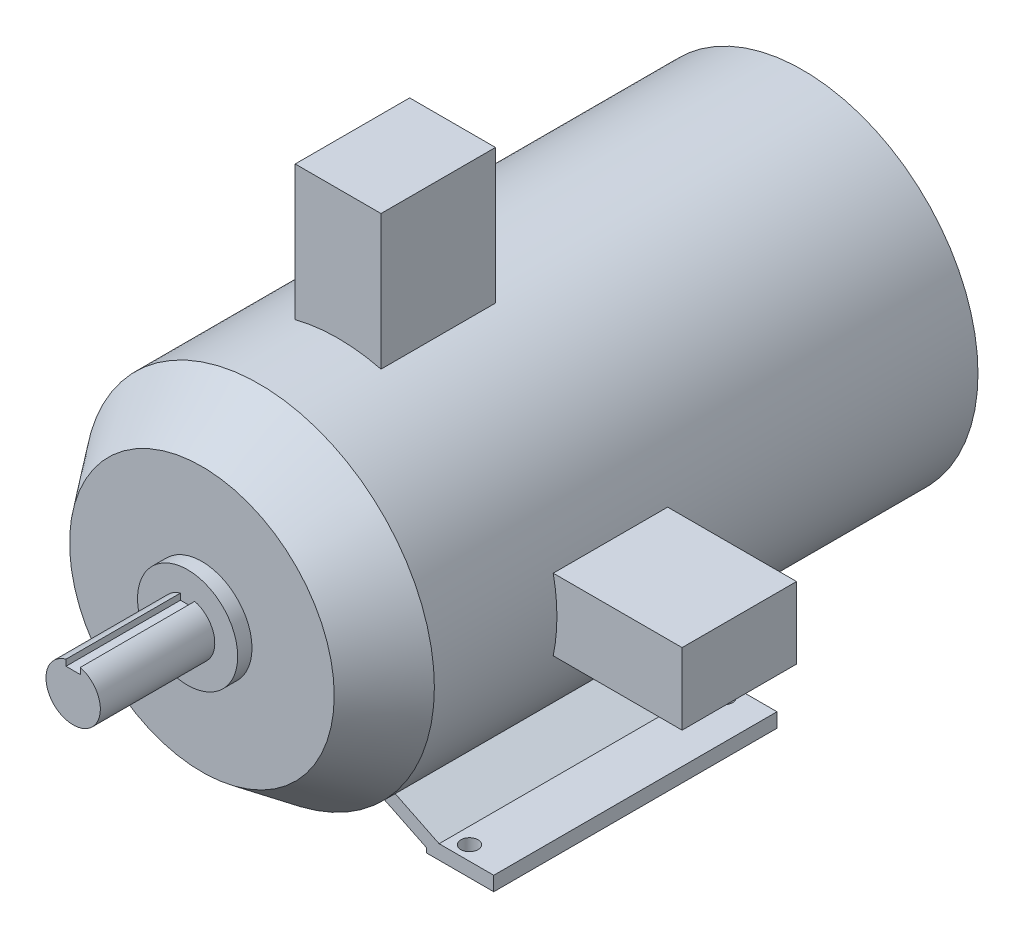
ISO-10303-21;
HEADER;
FILE_DESCRIPTION(('STEP AP214'),'2;1');
FILE_NAME('part.step','',(''),(''),'','','');
FILE_SCHEMA(('AUTOMOTIVE_DESIGN { 1 0 10303 214 1 1 1 1 }'));
ENDSEC;
DATA;
#1=APPLICATION_CONTEXT('core data for automotive mechanical design processes');
#2=APPLICATION_PROTOCOL_DEFINITION('international standard','automotive_design',2000,#1);
#3=PRODUCT_CONTEXT('',#1,'mechanical');
#4=PRODUCT('Part','Part','',(#3));
#5=PRODUCT_RELATED_PRODUCT_CATEGORY('part','',(#4));
#6=PRODUCT_DEFINITION_FORMATION('','',#4);
#7=PRODUCT_DEFINITION_CONTEXT('part definition',#1,'design');
#8=PRODUCT_DEFINITION('design','',#6,#7);
#9=PRODUCT_DEFINITION_SHAPE('','',#8);
#10=(LENGTH_UNIT() NAMED_UNIT(*) SI_UNIT(.MILLI.,.METRE.));
#11=(NAMED_UNIT(*) PLANE_ANGLE_UNIT() SI_UNIT($,.RADIAN.));
#12=(NAMED_UNIT(*) SI_UNIT($,.STERADIAN.) SOLID_ANGLE_UNIT());
#13=UNCERTAINTY_MEASURE_WITH_UNIT(LENGTH_MEASURE(1.E-05),#10,'distance_accuracy_value','');
#14=(GEOMETRIC_REPRESENTATION_CONTEXT(3) GLOBAL_UNCERTAINTY_ASSIGNED_CONTEXT((#13)) GLOBAL_UNIT_ASSIGNED_CONTEXT((#10,
#11,#12)) REPRESENTATION_CONTEXT('',''));
#15=CARTESIAN_POINT('',(0.,0.,0.));
#16=DIRECTION('',(0.,0.,1.));
#17=DIRECTION('',(1.,0.,0.));
#18=AXIS2_PLACEMENT_3D('',#15,#16,#17);
#19=CARTESIAN_POINT('',(0.,0.,420.));
#20=DIRECTION('',(0.,0.,-1.));
#21=DIRECTION('',(-1.,0.,0.));
#22=AXIS2_PLACEMENT_3D('',#19,#20,#21);
#23=CYLINDRICAL_SURFACE('',#22,122.5);
#24=CARTESIAN_POINT('',(0.,0.,294.347417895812));
#25=DIRECTION('',(0.,0.,-1.));
#26=DIRECTION('',(-1.,0.,0.));
#27=AXIS2_PLACEMENT_3D('',#24,#25,#26);
#28=CIRCLE('',#27,122.5);
#29=CARTESIAN_POINT('',(119.921849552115,25.,294.347417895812));
#30=VERTEX_POINT('',#29);
#31=CARTESIAN_POINT('',(119.921849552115,-25.,294.347417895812));
#32=VERTEX_POINT('',#31);
#33=EDGE_CURVE('E445',#30,#32,#28,.T.);
#34=ORIENTED_EDGE('',*,*,#33,.F.);
#35=DIRECTION('',(0.,0.,-1.));
#36=VECTOR('',#35,1.);
#37=CARTESIAN_POINT('',(119.921849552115,25.,420.));
#38=LINE('',#37,#36);
#39=CARTESIAN_POINT('',(119.921849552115,25.,214.347417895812));
#40=VERTEX_POINT('',#39);
#41=EDGE_CURVE('E436',#40,#30,#38,.F.);
#42=ORIENTED_EDGE('',*,*,#41,.F.);
#43=CARTESIAN_POINT('',(0.,0.,214.347417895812));
#44=DIRECTION('',(0.,0.,1.));
#45=DIRECTION('',(1.,0.,0.));
#46=AXIS2_PLACEMENT_3D('',#43,#44,#45);
#47=CIRCLE('',#46,122.5);
#48=CARTESIAN_POINT('',(119.921849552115,-25.,214.347417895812));
#49=VERTEX_POINT('',#48);
#50=EDGE_CURVE('E439',#49,#40,#47,.T.);
#51=ORIENTED_EDGE('',*,*,#50,.F.);
#52=DIRECTION('',(0.,0.,-1.));
#53=VECTOR('',#52,1.);
#54=CARTESIAN_POINT('',(119.921849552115,-25.,420.));
#55=LINE('',#54,#53);
#56=EDGE_CURVE('E442',#32,#49,#55,.T.);
#57=ORIENTED_EDGE('',*,*,#56,.F.);
#58=EDGE_LOOP('',(#34,#42,#51,#57));
#59=FACE_BOUND('',#58,.T.);
#60=CARTESIAN_POINT('',(0.,0.,153.));
#61=DIRECTION('',(0.,0.,-1.));
#62=DIRECTION('',(1.,0.,0.));
#63=AXIS2_PLACEMENT_3D('',#60,#61,#62);
#64=CIRCLE('',#63,122.5);
#65=CARTESIAN_POINT('',(-51.6029201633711,-111.100803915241,153.));
#66=VERTEX_POINT('',#65);
#67=CARTESIAN_POINT('',(-62.5646904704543,-105.318134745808,153.));
#68=VERTEX_POINT('',#67);
#69=EDGE_CURVE('E364',#66,#68,#64,.T.);
#70=ORIENTED_EDGE('',*,*,#69,.T.);
#71=DIRECTION('',(0.,0.,1.));
#72=VECTOR('',#71,1.);
#73=CARTESIAN_POINT('',(-62.5646904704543,-105.318134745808,153.));
#74=LINE('',#73,#72);
#75=CARTESIAN_POINT('',(-62.5646904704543,-105.318134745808,351.));
#76=VERTEX_POINT('',#75);
#77=EDGE_CURVE('E384',#68,#76,#74,.T.);
#78=ORIENTED_EDGE('',*,*,#77,.T.);
#79=CARTESIAN_POINT('',(0.,0.,351.));
#80=DIRECTION('',(0.,0.,-1.));
#81=DIRECTION('',(1.,0.,0.));
#82=AXIS2_PLACEMENT_3D('',#79,#80,#81);
#83=CIRCLE('',#82,122.5);
#84=CARTESIAN_POINT('',(-51.6029201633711,-111.100803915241,351.));
#85=VERTEX_POINT('',#84);
#86=EDGE_CURVE('E343',#85,#76,#83,.T.);
#87=ORIENTED_EDGE('',*,*,#86,.F.);
#88=DIRECTION('',(0.,0.,1.));
#89=VECTOR('',#88,1.);
#90=CARTESIAN_POINT('',(-51.6029201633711,-111.100803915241,153.));
#91=LINE('',#90,#89);
#92=EDGE_CURVE('E387',#66,#85,#91,.T.);
#93=ORIENTED_EDGE('',*,*,#92,.F.);
#94=EDGE_LOOP('',(#70,#78,#87,#93));
#95=FACE_BOUND('',#94,.T.);
#96=CARTESIAN_POINT('',(0.,0.,0.));
#97=DIRECTION('',(0.,0.,1.));
#98=DIRECTION('',(1.,0.,0.));
#99=AXIS2_PLACEMENT_3D('',#96,#97,#98);
#100=CIRCLE('',#99,122.5);
#101=CARTESIAN_POINT('',(122.5,0.,0.));
#102=VERTEX_POINT('',#101);
#103=EDGE_CURVE('E433',#102,#102,#100,.T.);
#104=ORIENTED_EDGE('',*,*,#103,.T.);
#105=EDGE_LOOP('',(#104));
#106=FACE_BOUND('',#105,.T.);
#107=CARTESIAN_POINT('',(0.,0.,380.));
#108=DIRECTION('',(0.,0.,1.));
#109=DIRECTION('',(1.,0.,0.));
#110=AXIS2_PLACEMENT_3D('',#107,#108,#109);
#111=CIRCLE('',#110,122.5);
#112=CARTESIAN_POINT('',(122.5,0.,380.));
#113=VERTEX_POINT('',#112);
#114=EDGE_CURVE('E418',#113,#113,#111,.T.);
#115=ORIENTED_EDGE('',*,*,#114,.F.);
#116=EDGE_LOOP('',(#115));
#117=FACE_BOUND('',#116,.T.);
#118=CARTESIAN_POINT('',(0.,0.,153.));
#119=DIRECTION('',(0.,0.,-1.));
#120=DIRECTION('',(1.,0.,0.));
#121=AXIS2_PLACEMENT_3D('',#118,#119,#120);
#122=CIRCLE('',#121,122.5);
#123=CARTESIAN_POINT('',(62.5646904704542,-105.318134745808,153.));
#124=VERTEX_POINT('',#123);
#125=CARTESIAN_POINT('',(51.6029201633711,-111.100803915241,153.));
#126=VERTEX_POINT('',#125);
#127=EDGE_CURVE('E310',#124,#126,#122,.T.);
#128=ORIENTED_EDGE('',*,*,#127,.T.);
#129=DIRECTION('',(0.,0.,1.));
#130=VECTOR('',#129,1.);
#131=CARTESIAN_POINT('',(51.6029201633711,-111.100803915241,153.));
#132=LINE('',#131,#130);
#133=CARTESIAN_POINT('',(51.6029201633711,-111.100803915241,351.));
#134=VERTEX_POINT('',#133);
#135=EDGE_CURVE('E325',#126,#134,#132,.T.);
#136=ORIENTED_EDGE('',*,*,#135,.T.);
#137=CARTESIAN_POINT('',(0.,0.,351.));
#138=DIRECTION('',(0.,0.,-1.));
#139=DIRECTION('',(1.,0.,0.));
#140=AXIS2_PLACEMENT_3D('',#137,#138,#139);
#141=CIRCLE('',#140,122.5);
#142=CARTESIAN_POINT('',(62.5646904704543,-105.318134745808,351.));
#143=VERTEX_POINT('',#142);
#144=EDGE_CURVE('E289',#143,#134,#141,.T.);
#145=ORIENTED_EDGE('',*,*,#144,.F.);
#146=DIRECTION('',(0.,0.,1.));
#147=VECTOR('',#146,1.);
#148=CARTESIAN_POINT('',(62.5646904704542,-105.318134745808,153.));
#149=LINE('',#148,#147);
#150=EDGE_CURVE('E328',#124,#143,#149,.T.);
#151=ORIENTED_EDGE('',*,*,#150,.F.);
#152=EDGE_LOOP('',(#128,#136,#145,#151));
#153=FACE_BOUND('',#152,.T.);
#154=DIRECTION('',(0.,0.,-1.));
#155=VECTOR('',#154,1.);
#156=CARTESIAN_POINT('',(-30.,118.769735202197,420.));
#157=LINE('',#156,#155);
#158=CARTESIAN_POINT('',(-30.,118.769735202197,244.794007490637));
#159=VERTEX_POINT('',#158);
#160=CARTESIAN_POINT('',(-30.,118.769735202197,324.794007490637));
#161=VERTEX_POINT('',#160);
#162=EDGE_CURVE('E11',#159,#161,#157,.F.);
#163=ORIENTED_EDGE('',*,*,#162,.F.);
#164=CARTESIAN_POINT('',(0.,0.,244.794007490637));
#165=DIRECTION('',(0.,0.,1.));
#166=DIRECTION('',(1.,0.,0.));
#167=AXIS2_PLACEMENT_3D('',#164,#165,#166);
#168=CIRCLE('',#167,122.5);
#169=CARTESIAN_POINT('',(30.,118.769735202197,244.794007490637));
#170=VERTEX_POINT('',#169);
#171=EDGE_CURVE('E448',#170,#159,#168,.T.);
#172=ORIENTED_EDGE('',*,*,#171,.F.);
#173=DIRECTION('',(0.,0.,-1.));
#174=VECTOR('',#173,1.);
#175=CARTESIAN_POINT('',(30.,118.769735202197,420.));
#176=LINE('',#175,#174);
#177=CARTESIAN_POINT('',(30.,118.769735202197,324.794007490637));
#178=VERTEX_POINT('',#177);
#179=EDGE_CURVE('E56',#178,#170,#176,.T.);
#180=ORIENTED_EDGE('',*,*,#179,.F.);
#181=CARTESIAN_POINT('',(0.,0.,324.794007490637));
#182=DIRECTION('',(0.,0.,-1.));
#183=DIRECTION('',(-1.,0.,0.));
#184=AXIS2_PLACEMENT_3D('',#181,#182,#183);
#185=CIRCLE('',#184,122.5);
#186=EDGE_CURVE('E46',#161,#178,#185,.T.);
#187=ORIENTED_EDGE('',*,*,#186,.F.);
#188=EDGE_LOOP('',(#163,#172,#180,#187));
#189=FACE_BOUND('',#188,.T.);
#190=ADVANCED_FACE('F39',(#59,#95,#106,#117,#153,#189),#23,.T.);
#191=CARTESIAN_POINT('',(0.,0.,420.));
#192=DIRECTION('',(0.,0.,1.));
#193=DIRECTION('',(1.,0.,0.));
#194=AXIS2_PLACEMENT_3D('',#191,#192,#193);
#195=PLANE('',#194);
#196=CARTESIAN_POINT('',(0.,0.,420.));
#197=DIRECTION('',(0.,0.,1.));
#198=DIRECTION('',(1.,0.,0.));
#199=AXIS2_PLACEMENT_3D('',#196,#197,#198);
#200=CIRCLE('',#199,35.);
#201=CARTESIAN_POINT('',(35.,0.,420.));
#202=VERTEX_POINT('',#201);
#203=EDGE_CURVE('E427',#202,#202,#200,.T.);
#204=ORIENTED_EDGE('',*,*,#203,.F.);
#205=EDGE_LOOP('',(#204));
#206=FACE_BOUND('',#205,.T.);
#207=CARTESIAN_POINT('',(0.,0.,420.));
#208=DIRECTION('',(0.,0.,1.));
#209=DIRECTION('',(1.,0.,0.));
#210=AXIS2_PLACEMENT_3D('',#207,#208,#209);
#211=CIRCLE('',#210,92.5);
#212=CARTESIAN_POINT('',(92.5,0.,420.));
#213=VERTEX_POINT('',#212);
#214=EDGE_CURVE('E415',#213,#213,#211,.T.);
#215=ORIENTED_EDGE('',*,*,#214,.T.);
#216=EDGE_LOOP('',(#215));
#217=FACE_BOUND('',#216,.T.);
#218=ADVANCED_FACE('F462',(#206,#217),#195,.T.);
#219=CARTESIAN_POINT('',(0.,0.,430.));
#220=DIRECTION('',(0.,0.,1.));
#221=DIRECTION('',(1.,0.,0.));
#222=AXIS2_PLACEMENT_3D('',#219,#220,#221);
#223=PLANE('',#222);
#224=CARTESIAN_POINT('',(0.,0.,430.));
#225=DIRECTION('',(0.,0.,1.));
#226=DIRECTION('',(1.,0.,0.));
#227=AXIS2_PLACEMENT_3D('',#224,#225,#226);
#228=CIRCLE('',#227,35.);
#229=CARTESIAN_POINT('',(35.,0.,430.));
#230=VERTEX_POINT('',#229);
#231=EDGE_CURVE('E430',#230,#230,#228,.T.);
#232=ORIENTED_EDGE('',*,*,#231,.T.);
#233=EDGE_LOOP('',(#232));
#234=FACE_BOUND('',#233,.T.);
#235=CARTESIAN_POINT('',(0.,0.,430.));
#236=DIRECTION('',(0.,0.,1.));
#237=DIRECTION('',(1.,0.,0.));
#238=AXIS2_PLACEMENT_3D('',#235,#236,#237);
#239=CIRCLE('',#238,19.);
#240=CARTESIAN_POINT('',(-4.99999999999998,18.3303027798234,430.));
#241=VERTEX_POINT('',#240);
#242=CARTESIAN_POINT('',(5.00000000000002,18.3303027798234,430.));
#243=VERTEX_POINT('',#242);
#244=EDGE_CURVE('E421',#241,#243,#239,.T.);
#245=ORIENTED_EDGE('',*,*,#244,.F.);
#246=DIRECTION('',(0.,1.,0.));
#247=VECTOR('',#246,1.);
#248=CARTESIAN_POINT('',(-4.99999999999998,18.3303027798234,430.));
#249=LINE('',#248,#247);
#250=CARTESIAN_POINT('',(-4.99999999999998,14.,430.));
#251=VERTEX_POINT('',#250);
#252=EDGE_CURVE('E398',#251,#241,#249,.T.);
#253=ORIENTED_EDGE('',*,*,#252,.F.);
#254=DIRECTION('',(-1.,0.,0.));
#255=VECTOR('',#254,1.);
#256=CARTESIAN_POINT('',(-4.99999999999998,14.,430.));
#257=LINE('',#256,#255);
#258=CARTESIAN_POINT('',(5.00000000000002,14.,430.));
#259=VERTEX_POINT('',#258);
#260=EDGE_CURVE('E393',#259,#251,#257,.T.);
#261=ORIENTED_EDGE('',*,*,#260,.F.);
#262=DIRECTION('',(0.,-1.,0.));
#263=VECTOR('',#262,1.);
#264=CARTESIAN_POINT('',(5.00000000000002,14.,430.));
#265=LINE('',#264,#263);
#266=EDGE_CURVE('E395',#243,#259,#265,.T.);
#267=ORIENTED_EDGE('',*,*,#266,.F.);
#268=EDGE_LOOP('',(#245,#253,#261,#267));
#269=FACE_BOUND('',#268,.T.);
#270=ADVANCED_FACE('F469',(#234,#269),#223,.T.);
#271=CARTESIAN_POINT('',(0.,0.,430.));
#272=DIRECTION('',(0.,0.,-1.));
#273=DIRECTION('',(-1.,0.,0.));
#274=AXIS2_PLACEMENT_3D('',#271,#272,#273);
#275=CYLINDRICAL_SURFACE('',#274,35.);
#276=ORIENTED_EDGE('',*,*,#231,.F.);
#277=EDGE_LOOP('',(#276));
#278=FACE_BOUND('',#277,.T.);
#279=ORIENTED_EDGE('',*,*,#203,.T.);
#280=EDGE_LOOP('',(#279));
#281=FACE_BOUND('',#280,.T.);
#282=ADVANCED_FACE('F590',(#278,#281),#275,.T.);
#283=CARTESIAN_POINT('',(0.,0.,510.));
#284=DIRECTION('',(0.,0.,-1.));
#285=DIRECTION('',(-1.,0.,0.));
#286=AXIS2_PLACEMENT_3D('',#283,#284,#285);
#287=CYLINDRICAL_SURFACE('',#286,19.);
#288=ORIENTED_EDGE('',*,*,#244,.T.);
#289=DIRECTION('',(0.,0.,1.));
#290=VECTOR('',#289,1.);
#291=CARTESIAN_POINT('',(5.00000000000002,18.3303027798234,418.819660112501));
#292=LINE('',#291,#290);
#293=CARTESIAN_POINT('',(5.00000000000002,18.3303027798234,510.));
#294=VERTEX_POINT('',#293);
#295=EDGE_CURVE('E396',#243,#294,#292,.T.);
#296=ORIENTED_EDGE('',*,*,#295,.T.);
#297=CARTESIAN_POINT('',(0.,0.,510.));
#298=DIRECTION('',(0.,0.,1.));
#299=DIRECTION('',(1.,0.,0.));
#300=AXIS2_PLACEMENT_3D('',#297,#298,#299);
#301=CIRCLE('',#300,19.);
#302=CARTESIAN_POINT('',(-4.99999999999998,18.3303027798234,510.));
#303=VERTEX_POINT('',#302);
#304=EDGE_CURVE('E424',#303,#294,#301,.T.);
#305=ORIENTED_EDGE('',*,*,#304,.F.);
#306=DIRECTION('',(0.,0.,1.));
#307=VECTOR('',#306,1.);
#308=CARTESIAN_POINT('',(-4.99999999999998,18.3303027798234,418.819660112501));
#309=LINE('',#308,#307);
#310=EDGE_CURVE('E406',#241,#303,#309,.T.);
#311=ORIENTED_EDGE('',*,*,#310,.F.);
#312=EDGE_LOOP('',(#288,#296,#305,#311));
#313=FACE_BOUND('',#312,.T.);
#314=ADVANCED_FACE('F586',(#313),#287,.T.);
#315=CARTESIAN_POINT('',(0.,0.,510.));
#316=DIRECTION('',(0.,0.,1.));
#317=DIRECTION('',(1.,0.,0.));
#318=AXIS2_PLACEMENT_3D('',#315,#316,#317);
#319=PLANE('',#318);
#320=DIRECTION('',(0.,1.,0.));
#321=VECTOR('',#320,1.);
#322=CARTESIAN_POINT('',(5.00000000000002,14.,510.));
#323=LINE('',#322,#321);
#324=CARTESIAN_POINT('',(5.00000000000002,14.,510.));
#325=VERTEX_POINT('',#324);
#326=EDGE_CURVE('E404',#325,#294,#323,.T.);
#327=ORIENTED_EDGE('',*,*,#326,.F.);
#328=DIRECTION('',(1.,0.,0.));
#329=VECTOR('',#328,1.);
#330=CARTESIAN_POINT('',(-4.99999999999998,14.,510.));
#331=LINE('',#330,#329);
#332=CARTESIAN_POINT('',(-4.99999999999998,14.,510.));
#333=VERTEX_POINT('',#332);
#334=EDGE_CURVE('E401',#333,#325,#331,.T.);
#335=ORIENTED_EDGE('',*,*,#334,.F.);
#336=DIRECTION('',(0.,-1.,0.));
#337=VECTOR('',#336,1.);
#338=CARTESIAN_POINT('',(-4.99999999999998,18.3303027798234,510.));
#339=LINE('',#338,#337);
#340=EDGE_CURVE('E379',#303,#333,#339,.T.);
#341=ORIENTED_EDGE('',*,*,#340,.F.);
#342=ORIENTED_EDGE('',*,*,#304,.T.);
#343=EDGE_LOOP('',(#327,#335,#341,#342));
#344=FACE_BOUND('',#343,.T.);
#345=ADVANCED_FACE('F582',(#344),#319,.T.);
#346=CARTESIAN_POINT('',(0.,0.,420.));
#347=DIRECTION('',(0.,0.,-1.));
#348=DIRECTION('',(-1.,0.,0.));
#349=AXIS2_PLACEMENT_3D('',#346,#347,#348);
#350=CONICAL_SURFACE('',#349,92.5,0.643501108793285);
#351=ORIENTED_EDGE('',*,*,#114,.T.);
#352=EDGE_LOOP('',(#351));
#353=FACE_BOUND('',#352,.T.);
#354=ORIENTED_EDGE('',*,*,#214,.F.);
#355=EDGE_LOOP('',(#354));
#356=FACE_BOUND('',#355,.T.);
#357=ADVANCED_FACE('F579',(#353,#356),#350,.T.);
#358=CARTESIAN_POINT('',(0.,0.,0.));
#359=DIRECTION('',(0.,0.,1.));
#360=DIRECTION('',(1.,0.,0.));
#361=AXIS2_PLACEMENT_3D('',#358,#359,#360);
#362=PLANE('',#361);
#363=ORIENTED_EDGE('',*,*,#103,.F.);
#364=EDGE_LOOP('',(#363));
#365=FACE_BOUND('',#364,.T.);
#366=ADVANCED_FACE('F571',(#365),#362,.F.);
#367=CARTESIAN_POINT('',(5.00000000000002,14.,418.819660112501));
#368=DIRECTION('',(1.,0.,0.));
#369=DIRECTION('',(0.,1.,0.));
#370=AXIS2_PLACEMENT_3D('',#367,#368,#369);
#371=PLANE('',#370);
#372=ORIENTED_EDGE('',*,*,#266,.T.);
#373=DIRECTION('',(0.,0.,1.));
#374=VECTOR('',#373,1.);
#375=CARTESIAN_POINT('',(5.00000000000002,14.,418.819660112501));
#376=LINE('',#375,#374);
#377=EDGE_CURVE('E409',#259,#325,#376,.T.);
#378=ORIENTED_EDGE('',*,*,#377,.T.);
#379=ORIENTED_EDGE('',*,*,#326,.T.);
#380=ORIENTED_EDGE('',*,*,#295,.F.);
#381=EDGE_LOOP('',(#372,#378,#379,#380));
#382=FACE_BOUND('',#381,.T.);
#383=ADVANCED_FACE('F567',(#382),#371,.F.);
#384=CARTESIAN_POINT('',(-4.99999999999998,14.,418.819660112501));
#385=DIRECTION('',(0.,-1.,0.));
#386=DIRECTION('',(0.,0.,-1.));
#387=AXIS2_PLACEMENT_3D('',#384,#385,#386);
#388=PLANE('',#387);
#389=ORIENTED_EDGE('',*,*,#260,.T.);
#390=DIRECTION('',(0.,0.,1.));
#391=VECTOR('',#390,1.);
#392=CARTESIAN_POINT('',(-4.99999999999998,14.,418.819660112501));
#393=LINE('',#392,#391);
#394=EDGE_CURVE('E411',#251,#333,#393,.T.);
#395=ORIENTED_EDGE('',*,*,#394,.T.);
#396=ORIENTED_EDGE('',*,*,#334,.T.);
#397=ORIENTED_EDGE('',*,*,#377,.F.);
#398=EDGE_LOOP('',(#389,#395,#396,#397));
#399=FACE_BOUND('',#398,.T.);
#400=ADVANCED_FACE('F570',(#399),#388,.F.);
#401=CARTESIAN_POINT('',(-4.99999999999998,18.3303027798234,418.819660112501));
#402=DIRECTION('',(-1.,0.,0.));
#403=DIRECTION('',(0.,0.,1.));
#404=AXIS2_PLACEMENT_3D('',#401,#402,#403);
#405=PLANE('',#404);
#406=ORIENTED_EDGE('',*,*,#252,.T.);
#407=ORIENTED_EDGE('',*,*,#310,.T.);
#408=ORIENTED_EDGE('',*,*,#340,.T.);
#409=ORIENTED_EDGE('',*,*,#394,.F.);
#410=EDGE_LOOP('',(#406,#407,#408,#409));
#411=FACE_BOUND('',#410,.T.);
#412=ADVANCED_FACE('F565',(#411),#405,.F.);
#413=CARTESIAN_POINT('',(-88.,-132.,153.));
#414=DIRECTION('',(0.,-1.,0.));
#415=DIRECTION('',(0.,0.,-1.));
#416=AXIS2_PLACEMENT_3D('',#413,#414,#415);
#417=PLANE('',#416);
#418=CARTESIAN_POINT('',(-108.,-132.,163.));
#419=DIRECTION('',(0.,-1.,0.));
#420=DIRECTION('',(0.,0.,-1.));
#421=AXIS2_PLACEMENT_3D('',#418,#419,#420);
#422=CIRCLE('',#421,6.);
#423=CARTESIAN_POINT('',(-108.,-132.,157.));
#424=VERTEX_POINT('',#423);
#425=EDGE_CURVE('E254',#424,#424,#422,.T.);
#426=ORIENTED_EDGE('',*,*,#425,.F.);
#427=EDGE_LOOP('',(#426));
#428=FACE_BOUND('',#427,.T.);
#429=CARTESIAN_POINT('',(-108.,-132.,341.));
#430=DIRECTION('',(0.,-1.,0.));
#431=DIRECTION('',(0.,0.,-1.));
#432=AXIS2_PLACEMENT_3D('',#429,#430,#431);
#433=CIRCLE('',#432,6.);
#434=CARTESIAN_POINT('',(-108.,-132.,335.));
#435=VERTEX_POINT('',#434);
#436=EDGE_CURVE('E260',#435,#435,#433,.T.);
#437=ORIENTED_EDGE('',*,*,#436,.F.);
#438=EDGE_LOOP('',(#437));
#439=FACE_BOUND('',#438,.T.);
#440=DIRECTION('',(1.,0.,0.));
#441=VECTOR('',#440,1.);
#442=CARTESIAN_POINT('',(-88.,-132.,351.));
#443=LINE('',#442,#441);
#444=CARTESIAN_POINT('',(-135.,-132.,351.));
#445=VERTEX_POINT('',#444);
#446=CARTESIAN_POINT('',(-88.,-132.,351.));
#447=VERTEX_POINT('',#446);
#448=EDGE_CURVE('E322',#445,#447,#443,.T.);
#449=ORIENTED_EDGE('',*,*,#448,.F.);
#450=DIRECTION('',(0.,0.,1.));
#451=VECTOR('',#450,1.);
#452=CARTESIAN_POINT('',(-135.,-132.,153.));
#453=LINE('',#452,#451);
#454=CARTESIAN_POINT('',(-135.,-132.,153.));
#455=VERTEX_POINT('',#454);
#456=EDGE_CURVE('E377',#455,#445,#453,.T.);
#457=ORIENTED_EDGE('',*,*,#456,.F.);
#458=DIRECTION('',(1.,0.,0.));
#459=VECTOR('',#458,1.);
#460=CARTESIAN_POINT('',(-88.,-132.,153.));
#461=LINE('',#460,#459);
#462=CARTESIAN_POINT('',(-88.,-132.,153.));
#463=VERTEX_POINT('',#462);
#464=EDGE_CURVE('E355',#455,#463,#461,.T.);
#465=ORIENTED_EDGE('',*,*,#464,.T.);
#466=DIRECTION('',(0.,0.,1.));
#467=VECTOR('',#466,1.);
#468=CARTESIAN_POINT('',(-88.,-132.,153.));
#469=LINE('',#468,#467);
#470=EDGE_CURVE('E376',#463,#447,#469,.T.);
#471=ORIENTED_EDGE('',*,*,#470,.T.);
#472=EDGE_LOOP('',(#449,#457,#465,#471));
#473=FACE_BOUND('',#472,.T.);
#474=ADVANCED_FACE('F548',(#428,#439,#473),#417,.T.);
#475=CARTESIAN_POINT('',(-135.,-132.,153.));
#476=DIRECTION('',(-1.,0.,0.));
#477=DIRECTION('',(0.,-1.,0.));
#478=AXIS2_PLACEMENT_3D('',#475,#476,#477);
#479=PLANE('',#478);
#480=DIRECTION('',(0.,-1.,0.));
#481=VECTOR('',#480,1.);
#482=CARTESIAN_POINT('',(-135.,-132.,351.));
#483=LINE('',#482,#481);
#484=CARTESIAN_POINT('',(-135.,-122.,351.));
#485=VERTEX_POINT('',#484);
#486=EDGE_CURVE('E352',#485,#445,#483,.T.);
#487=ORIENTED_EDGE('',*,*,#486,.F.);
#488=DIRECTION('',(0.,0.,1.));
#489=VECTOR('',#488,1.);
#490=CARTESIAN_POINT('',(-135.,-122.,153.));
#491=LINE('',#490,#489);
#492=CARTESIAN_POINT('',(-135.,-122.,153.));
#493=VERTEX_POINT('',#492);
#494=EDGE_CURVE('E380',#493,#485,#491,.T.);
#495=ORIENTED_EDGE('',*,*,#494,.F.);
#496=DIRECTION('',(0.,-1.,0.));
#497=VECTOR('',#496,1.);
#498=CARTESIAN_POINT('',(-135.,-132.,153.));
#499=LINE('',#498,#497);
#500=EDGE_CURVE('E373',#493,#455,#499,.T.);
#501=ORIENTED_EDGE('',*,*,#500,.T.);
#502=ORIENTED_EDGE('',*,*,#456,.T.);
#503=EDGE_LOOP('',(#487,#495,#501,#502));
#504=FACE_BOUND('',#503,.T.);
#505=ADVANCED_FACE('F544',(#504),#479,.T.);
#506=CARTESIAN_POINT('',(-135.,-122.,153.));
#507=DIRECTION('',(0.,1.,0.));
#508=DIRECTION('',(0.,0.,1.));
#509=AXIS2_PLACEMENT_3D('',#506,#507,#508);
#510=PLANE('',#509);
#511=CARTESIAN_POINT('',(-108.,-122.,163.));
#512=DIRECTION('',(0.,-1.,0.));
#513=DIRECTION('',(0.,0.,-1.));
#514=AXIS2_PLACEMENT_3D('',#511,#512,#513);
#515=CIRCLE('',#514,6.);
#516=CARTESIAN_POINT('',(-108.,-122.,157.));
#517=VERTEX_POINT('',#516);
#518=EDGE_CURVE('E257',#517,#517,#515,.T.);
#519=ORIENTED_EDGE('',*,*,#518,.T.);
#520=EDGE_LOOP('',(#519));
#521=FACE_BOUND('',#520,.T.);
#522=CARTESIAN_POINT('',(-108.,-122.,341.));
#523=DIRECTION('',(0.,-1.,0.));
#524=DIRECTION('',(0.,0.,-1.));
#525=AXIS2_PLACEMENT_3D('',#522,#523,#524);
#526=CIRCLE('',#525,6.);
#527=CARTESIAN_POINT('',(-108.,-122.,335.));
#528=VERTEX_POINT('',#527);
#529=EDGE_CURVE('E263',#528,#528,#526,.T.);
#530=ORIENTED_EDGE('',*,*,#529,.T.);
#531=EDGE_LOOP('',(#530));
#532=FACE_BOUND('',#531,.T.);
#533=DIRECTION('',(-1.,0.,0.));
#534=VECTOR('',#533,1.);
#535=CARTESIAN_POINT('',(-135.,-122.,351.));
#536=LINE('',#535,#534);
#537=CARTESIAN_POINT('',(-96.8002525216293,-122.,351.));
#538=VERTEX_POINT('',#537);
#539=EDGE_CURVE('E349',#538,#485,#536,.T.);
#540=ORIENTED_EDGE('',*,*,#539,.F.);
#541=DIRECTION('',(0.,0.,1.));
#542=VECTOR('',#541,1.);
#543=CARTESIAN_POINT('',(-96.8002525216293,-122.,153.));
#544=LINE('',#543,#542);
#545=CARTESIAN_POINT('',(-96.8002525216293,-122.,153.));
#546=VERTEX_POINT('',#545);
#547=EDGE_CURVE('E382',#546,#538,#544,.T.);
#548=ORIENTED_EDGE('',*,*,#547,.F.);
#549=DIRECTION('',(-1.,0.,0.));
#550=VECTOR('',#549,1.);
#551=CARTESIAN_POINT('',(-135.,-122.,153.));
#552=LINE('',#551,#550);
#553=EDGE_CURVE('E370',#546,#493,#552,.T.);
#554=ORIENTED_EDGE('',*,*,#553,.T.);
#555=ORIENTED_EDGE('',*,*,#494,.T.);
#556=EDGE_LOOP('',(#540,#548,#554,#555));
#557=FACE_BOUND('',#556,.T.);
#558=ADVANCED_FACE('F547',(#521,#532,#557),#510,.T.);
#559=CARTESIAN_POINT('',(-62.5646904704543,-105.318134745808,153.));
#560=DIRECTION('',(-0.43803312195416,0.898958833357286,0.));
#561=DIRECTION('',(-0.898958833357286,-0.43803312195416,0.));
#562=AXIS2_PLACEMENT_3D('',#559,#560,#561);
#563=PLANE('',#562);
#564=DIRECTION('',(-0.898958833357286,-0.43803312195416,0.));
#565=VECTOR('',#564,1.);
#566=CARTESIAN_POINT('',(-62.5646904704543,-105.318134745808,351.));
#567=LINE('',#566,#565);
#568=EDGE_CURVE('E346',#76,#538,#567,.T.);
#569=ORIENTED_EDGE('',*,*,#568,.F.);
#570=ORIENTED_EDGE('',*,*,#77,.F.);
#571=DIRECTION('',(-0.898958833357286,-0.43803312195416,0.));
#572=VECTOR('',#571,1.);
#573=CARTESIAN_POINT('',(-62.5646904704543,-105.318134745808,153.));
#574=LINE('',#573,#572);
#575=EDGE_CURVE('E367',#68,#546,#574,.T.);
#576=ORIENTED_EDGE('',*,*,#575,.T.);
#577=ORIENTED_EDGE('',*,*,#547,.T.);
#578=EDGE_LOOP('',(#569,#570,#576,#577));
#579=FACE_BOUND('',#578,.T.);
#580=ADVANCED_FACE('F552',(#579),#563,.T.);
#581=CARTESIAN_POINT('',(-88.,-128.8359058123,153.));
#582=DIRECTION('',(0.438033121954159,-0.898958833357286,0.));
#583=DIRECTION('',(0.898958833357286,0.438033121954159,0.));
#584=AXIS2_PLACEMENT_3D('',#581,#582,#583);
#585=PLANE('',#584);
#586=DIRECTION('',(0.898958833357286,0.438033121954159,0.));
#587=VECTOR('',#586,1.);
#588=CARTESIAN_POINT('',(-88.,-128.8359058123,351.));
#589=LINE('',#588,#587);
#590=CARTESIAN_POINT('',(-88.,-128.8359058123,351.));
#591=VERTEX_POINT('',#590);
#592=EDGE_CURVE('E341',#591,#85,#589,.T.);
#593=ORIENTED_EDGE('',*,*,#592,.F.);
#594=DIRECTION('',(0.,0.,1.));
#595=VECTOR('',#594,1.);
#596=CARTESIAN_POINT('',(-88.,-128.8359058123,153.));
#597=LINE('',#596,#595);
#598=CARTESIAN_POINT('',(-88.,-128.8359058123,153.));
#599=VERTEX_POINT('',#598);
#600=EDGE_CURVE('E390',#599,#591,#597,.T.);
#601=ORIENTED_EDGE('',*,*,#600,.F.);
#602=DIRECTION('',(0.898958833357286,0.438033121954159,0.));
#603=VECTOR('',#602,1.);
#604=CARTESIAN_POINT('',(-88.,-128.8359058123,153.));
#605=LINE('',#604,#603);
#606=EDGE_CURVE('E361',#599,#66,#605,.T.);
#607=ORIENTED_EDGE('',*,*,#606,.T.);
#608=ORIENTED_EDGE('',*,*,#92,.T.);
#609=EDGE_LOOP('',(#593,#601,#607,#608));
#610=FACE_BOUND('',#609,.T.);
#611=ADVANCED_FACE('F556',(#610),#585,.T.);
#612=CARTESIAN_POINT('',(-88.,-128.8359058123,153.));
#613=DIRECTION('',(1.,0.,0.));
#614=DIRECTION('',(0.,0.,-1.));
#615=AXIS2_PLACEMENT_3D('',#612,#613,#614);
#616=PLANE('',#615);
#617=DIRECTION('',(0.,1.,0.));
#618=VECTOR('',#617,1.);
#619=CARTESIAN_POINT('',(-88.,-128.8359058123,351.));
#620=LINE('',#619,#618);
#621=EDGE_CURVE('E338',#447,#591,#620,.T.);
#622=ORIENTED_EDGE('',*,*,#621,.F.);
#623=ORIENTED_EDGE('',*,*,#470,.F.);
#624=DIRECTION('',(0.,1.,0.));
#625=VECTOR('',#624,1.);
#626=CARTESIAN_POINT('',(-88.,-128.8359058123,153.));
#627=LINE('',#626,#625);
#628=EDGE_CURVE('E358',#463,#599,#627,.T.);
#629=ORIENTED_EDGE('',*,*,#628,.T.);
#630=ORIENTED_EDGE('',*,*,#600,.T.);
#631=EDGE_LOOP('',(#622,#623,#629,#630));
#632=FACE_BOUND('',#631,.T.);
#633=ADVANCED_FACE('F542',(#632),#616,.T.);
#634=CARTESIAN_POINT('',(0.,0.,153.));
#635=DIRECTION('',(0.,0.,1.));
#636=DIRECTION('',(1.,0.,0.));
#637=AXIS2_PLACEMENT_3D('',#634,#635,#636);
#638=PLANE('',#637);
#639=ORIENTED_EDGE('',*,*,#464,.F.);
#640=ORIENTED_EDGE('',*,*,#500,.F.);
#641=ORIENTED_EDGE('',*,*,#553,.F.);
#642=ORIENTED_EDGE('',*,*,#575,.F.);
#643=ORIENTED_EDGE('',*,*,#69,.F.);
#644=ORIENTED_EDGE('',*,*,#606,.F.);
#645=ORIENTED_EDGE('',*,*,#628,.F.);
#646=EDGE_LOOP('',(#639,#640,#641,#642,#643,#644,#645));
#647=FACE_BOUND('',#646,.T.);
#648=ADVANCED_FACE('F538',(#647),#638,.F.);
#649=CARTESIAN_POINT('',(0.,0.,351.));
#650=DIRECTION('',(0.,0.,1.));
#651=DIRECTION('',(1.,0.,0.));
#652=AXIS2_PLACEMENT_3D('',#649,#650,#651);
#653=PLANE('',#652);
#654=ORIENTED_EDGE('',*,*,#448,.T.);
#655=ORIENTED_EDGE('',*,*,#621,.T.);
#656=ORIENTED_EDGE('',*,*,#592,.T.);
#657=ORIENTED_EDGE('',*,*,#86,.T.);
#658=ORIENTED_EDGE('',*,*,#568,.T.);
#659=ORIENTED_EDGE('',*,*,#539,.T.);
#660=ORIENTED_EDGE('',*,*,#486,.T.);
#661=EDGE_LOOP('',(#654,#655,#656,#657,#658,#659,#660));
#662=FACE_BOUND('',#661,.T.);
#663=ADVANCED_FACE('F534',(#662),#653,.T.);
#664=CARTESIAN_POINT('',(135.,-132.,153.));
#665=DIRECTION('',(0.,-1.,0.));
#666=DIRECTION('',(1.,0.,0.));
#667=AXIS2_PLACEMENT_3D('',#664,#665,#666);
#668=PLANE('',#667);
#669=CARTESIAN_POINT('',(108.,-132.,163.));
#670=DIRECTION('',(0.,-1.,0.));
#671=DIRECTION('',(0.,0.,-1.));
#672=AXIS2_PLACEMENT_3D('',#669,#670,#671);
#673=CIRCLE('',#672,6.);
#674=CARTESIAN_POINT('',(108.,-132.,157.));
#675=VERTEX_POINT('',#674);
#676=EDGE_CURVE('E266',#675,#675,#673,.T.);
#677=ORIENTED_EDGE('',*,*,#676,.F.);
#678=EDGE_LOOP('',(#677));
#679=FACE_BOUND('',#678,.T.);
#680=CARTESIAN_POINT('',(108.,-132.,341.));
#681=DIRECTION('',(0.,-1.,0.));
#682=DIRECTION('',(0.,0.,-1.));
#683=AXIS2_PLACEMENT_3D('',#680,#681,#682);
#684=CIRCLE('',#683,6.);
#685=CARTESIAN_POINT('',(108.,-132.,335.));
#686=VERTEX_POINT('',#685);
#687=EDGE_CURVE('E272',#686,#686,#684,.T.);
#688=ORIENTED_EDGE('',*,*,#687,.F.);
#689=EDGE_LOOP('',(#688));
#690=FACE_BOUND('',#689,.T.);
#691=DIRECTION('',(1.,0.,0.));
#692=VECTOR('',#691,1.);
#693=CARTESIAN_POINT('',(135.,-132.,351.));
#694=LINE('',#693,#692);
#695=CARTESIAN_POINT('',(88.,-132.,351.));
#696=VERTEX_POINT('',#695);
#697=CARTESIAN_POINT('',(135.,-132.,351.));
#698=VERTEX_POINT('',#697);
#699=EDGE_CURVE('E278',#696,#698,#694,.T.);
#700=ORIENTED_EDGE('',*,*,#699,.F.);
#701=DIRECTION('',(0.,0.,1.));
#702=VECTOR('',#701,1.);
#703=CARTESIAN_POINT('',(88.,-132.,153.));
#704=LINE('',#703,#702);
#705=CARTESIAN_POINT('',(88.,-132.,153.));
#706=VERTEX_POINT('',#705);
#707=EDGE_CURVE('E320',#706,#696,#704,.T.);
#708=ORIENTED_EDGE('',*,*,#707,.F.);
#709=DIRECTION('',(1.,0.,0.));
#710=VECTOR('',#709,1.);
#711=CARTESIAN_POINT('',(135.,-132.,153.));
#712=LINE('',#711,#710);
#713=CARTESIAN_POINT('',(135.,-132.,153.));
#714=VERTEX_POINT('',#713);
#715=EDGE_CURVE('E298',#706,#714,#712,.T.);
#716=ORIENTED_EDGE('',*,*,#715,.T.);
#717=DIRECTION('',(0.,0.,1.));
#718=VECTOR('',#717,1.);
#719=CARTESIAN_POINT('',(135.,-132.,153.));
#720=LINE('',#719,#718);
#721=EDGE_CURVE('E319',#714,#698,#720,.T.);
#722=ORIENTED_EDGE('',*,*,#721,.T.);
#723=EDGE_LOOP('',(#700,#708,#716,#722));
#724=FACE_BOUND('',#723,.T.);
#725=ADVANCED_FACE('F499',(#679,#690,#724),#668,.T.);
#726=CARTESIAN_POINT('',(88.,-132.,153.));
#727=DIRECTION('',(-1.,0.,0.));
#728=DIRECTION('',(0.,0.,1.));
#729=AXIS2_PLACEMENT_3D('',#726,#727,#728);
#730=PLANE('',#729);
#731=DIRECTION('',(0.,-1.,0.));
#732=VECTOR('',#731,1.);
#733=CARTESIAN_POINT('',(88.,-132.,351.));
#734=LINE('',#733,#732);
#735=CARTESIAN_POINT('',(88.,-128.8359058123,351.));
#736=VERTEX_POINT('',#735);
#737=EDGE_CURVE('E295',#736,#696,#734,.T.);
#738=ORIENTED_EDGE('',*,*,#737,.F.);
#739=DIRECTION('',(0.,0.,1.));
#740=VECTOR('',#739,1.);
#741=CARTESIAN_POINT('',(88.,-128.8359058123,153.));
#742=LINE('',#741,#740);
#743=CARTESIAN_POINT('',(88.,-128.8359058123,153.));
#744=VERTEX_POINT('',#743);
#745=EDGE_CURVE('E323',#744,#736,#742,.T.);
#746=ORIENTED_EDGE('',*,*,#745,.F.);
#747=DIRECTION('',(0.,-1.,0.));
#748=VECTOR('',#747,1.);
#749=CARTESIAN_POINT('',(88.,-132.,153.));
#750=LINE('',#749,#748);
#751=EDGE_CURVE('E316',#744,#706,#750,.T.);
#752=ORIENTED_EDGE('',*,*,#751,.T.);
#753=ORIENTED_EDGE('',*,*,#707,.T.);
#754=EDGE_LOOP('',(#738,#746,#752,#753));
#755=FACE_BOUND('',#754,.T.);
#756=ADVANCED_FACE('F502',(#755),#730,.T.);
#757=CARTESIAN_POINT('',(51.6029201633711,-111.100803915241,153.));
#758=DIRECTION('',(-0.438033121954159,-0.898958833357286,0.));
#759=DIRECTION('',(0.898958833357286,-0.438033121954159,0.));
#760=AXIS2_PLACEMENT_3D('',#757,#758,#759);
#761=PLANE('',#760);
#762=DIRECTION('',(0.898958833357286,-0.438033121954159,0.));
#763=VECTOR('',#762,1.);
#764=CARTESIAN_POINT('',(51.6029201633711,-111.100803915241,351.));
#765=LINE('',#764,#763);
#766=EDGE_CURVE('E292',#134,#736,#765,.T.);
#767=ORIENTED_EDGE('',*,*,#766,.F.);
#768=ORIENTED_EDGE('',*,*,#135,.F.);
#769=DIRECTION('',(0.898958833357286,-0.438033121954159,0.));
#770=VECTOR('',#769,1.);
#771=CARTESIAN_POINT('',(51.6029201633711,-111.100803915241,153.));
#772=LINE('',#771,#770);
#773=EDGE_CURVE('E313',#126,#744,#772,.T.);
#774=ORIENTED_EDGE('',*,*,#773,.T.);
#775=ORIENTED_EDGE('',*,*,#745,.T.);
#776=EDGE_LOOP('',(#767,#768,#774,#775));
#777=FACE_BOUND('',#776,.T.);
#778=ADVANCED_FACE('F504',(#777),#761,.T.);
#779=CARTESIAN_POINT('',(96.8002525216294,-122.,153.));
#780=DIRECTION('',(0.438033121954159,0.898958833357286,0.));
#781=DIRECTION('',(-0.898958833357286,0.438033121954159,0.));
#782=AXIS2_PLACEMENT_3D('',#779,#780,#781);
#783=PLANE('',#782);
#784=DIRECTION('',(-0.898958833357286,0.438033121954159,0.));
#785=VECTOR('',#784,1.);
#786=CARTESIAN_POINT('',(96.8002525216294,-122.,351.));
#787=LINE('',#786,#785);
#788=CARTESIAN_POINT('',(96.8002525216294,-122.,351.));
#789=VERTEX_POINT('',#788);
#790=EDGE_CURVE('E287',#789,#143,#787,.T.);
#791=ORIENTED_EDGE('',*,*,#790,.F.);
#792=DIRECTION('',(0.,0.,1.));
#793=VECTOR('',#792,1.);
#794=CARTESIAN_POINT('',(96.8002525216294,-122.,153.));
#795=LINE('',#794,#793);
#796=CARTESIAN_POINT('',(96.8002525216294,-122.,153.));
#797=VERTEX_POINT('',#796);
#798=EDGE_CURVE('E331',#797,#789,#795,.T.);
#799=ORIENTED_EDGE('',*,*,#798,.F.);
#800=DIRECTION('',(-0.898958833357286,0.438033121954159,0.));
#801=VECTOR('',#800,1.);
#802=CARTESIAN_POINT('',(96.8002525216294,-122.,153.));
#803=LINE('',#802,#801);
#804=EDGE_CURVE('E307',#797,#124,#803,.T.);
#805=ORIENTED_EDGE('',*,*,#804,.T.);
#806=ORIENTED_EDGE('',*,*,#150,.T.);
#807=EDGE_LOOP('',(#791,#799,#805,#806));
#808=FACE_BOUND('',#807,.T.);
#809=ADVANCED_FACE('F489',(#808),#783,.T.);
#810=CARTESIAN_POINT('',(96.8002525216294,-122.,153.));
#811=DIRECTION('',(0.,1.,0.));
#812=DIRECTION('',(0.,0.,1.));
#813=AXIS2_PLACEMENT_3D('',#810,#811,#812);
#814=PLANE('',#813);
#815=CARTESIAN_POINT('',(108.,-122.,163.));
#816=DIRECTION('',(0.,-1.,0.));
#817=DIRECTION('',(0.,0.,-1.));
#818=AXIS2_PLACEMENT_3D('',#815,#816,#817);
#819=CIRCLE('',#818,6.);
#820=CARTESIAN_POINT('',(108.,-122.,157.));
#821=VERTEX_POINT('',#820);
#822=EDGE_CURVE('E269',#821,#821,#819,.T.);
#823=ORIENTED_EDGE('',*,*,#822,.T.);
#824=EDGE_LOOP('',(#823));
#825=FACE_BOUND('',#824,.T.);
#826=CARTESIAN_POINT('',(108.,-122.,341.));
#827=DIRECTION('',(0.,-1.,0.));
#828=DIRECTION('',(0.,0.,-1.));
#829=AXIS2_PLACEMENT_3D('',#826,#827,#828);
#830=CIRCLE('',#829,6.);
#831=CARTESIAN_POINT('',(108.,-122.,335.));
#832=VERTEX_POINT('',#831);
#833=EDGE_CURVE('E275',#832,#832,#830,.T.);
#834=ORIENTED_EDGE('',*,*,#833,.T.);
#835=EDGE_LOOP('',(#834));
#836=FACE_BOUND('',#835,.T.);
#837=DIRECTION('',(-1.,0.,0.));
#838=VECTOR('',#837,1.);
#839=CARTESIAN_POINT('',(96.8002525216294,-122.,351.));
#840=LINE('',#839,#838);
#841=CARTESIAN_POINT('',(135.,-122.,351.));
#842=VERTEX_POINT('',#841);
#843=EDGE_CURVE('E284',#842,#789,#840,.T.);
#844=ORIENTED_EDGE('',*,*,#843,.F.);
#845=DIRECTION('',(0.,0.,1.));
#846=VECTOR('',#845,1.);
#847=CARTESIAN_POINT('',(135.,-122.,153.));
#848=LINE('',#847,#846);
#849=CARTESIAN_POINT('',(135.,-122.,153.));
#850=VERTEX_POINT('',#849);
#851=EDGE_CURVE('E333',#850,#842,#848,.T.);
#852=ORIENTED_EDGE('',*,*,#851,.F.);
#853=DIRECTION('',(-1.,0.,0.));
#854=VECTOR('',#853,1.);
#855=CARTESIAN_POINT('',(96.8002525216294,-122.,153.));
#856=LINE('',#855,#854);
#857=EDGE_CURVE('E304',#850,#797,#856,.T.);
#858=ORIENTED_EDGE('',*,*,#857,.T.);
#859=ORIENTED_EDGE('',*,*,#798,.T.);
#860=EDGE_LOOP('',(#844,#852,#858,#859));
#861=FACE_BOUND('',#860,.T.);
#862=ADVANCED_FACE('F492',(#825,#836,#861),#814,.T.);
#863=CARTESIAN_POINT('',(135.,-122.,153.));
#864=DIRECTION('',(1.,0.,0.));
#865=DIRECTION('',(0.,1.,0.));
#866=AXIS2_PLACEMENT_3D('',#863,#864,#865);
#867=PLANE('',#866);
#868=DIRECTION('',(0.,1.,0.));
#869=VECTOR('',#868,1.);
#870=CARTESIAN_POINT('',(135.,-122.,351.));
#871=LINE('',#870,#869);
#872=EDGE_CURVE('E281',#698,#842,#871,.T.);
#873=ORIENTED_EDGE('',*,*,#872,.F.);
#874=ORIENTED_EDGE('',*,*,#721,.F.);
#875=DIRECTION('',(0.,1.,0.));
#876=VECTOR('',#875,1.);
#877=CARTESIAN_POINT('',(135.,-122.,153.));
#878=LINE('',#877,#876);
#879=EDGE_CURVE('E301',#714,#850,#878,.T.);
#880=ORIENTED_EDGE('',*,*,#879,.T.);
#881=ORIENTED_EDGE('',*,*,#851,.T.);
#882=EDGE_LOOP('',(#873,#874,#880,#881));
#883=FACE_BOUND('',#882,.T.);
#884=ADVANCED_FACE('F496',(#883),#867,.T.);
#885=CARTESIAN_POINT('',(0.,0.,153.));
#886=DIRECTION('',(0.,0.,1.));
#887=DIRECTION('',(1.,0.,0.));
#888=AXIS2_PLACEMENT_3D('',#885,#886,#887);
#889=PLANE('',#888);
#890=ORIENTED_EDGE('',*,*,#715,.F.);
#891=ORIENTED_EDGE('',*,*,#751,.F.);
#892=ORIENTED_EDGE('',*,*,#773,.F.);
#893=ORIENTED_EDGE('',*,*,#127,.F.);
#894=ORIENTED_EDGE('',*,*,#804,.F.);
#895=ORIENTED_EDGE('',*,*,#857,.F.);
#896=ORIENTED_EDGE('',*,*,#879,.F.);
#897=EDGE_LOOP('',(#890,#891,#892,#893,#894,#895,#896));
#898=FACE_BOUND('',#897,.T.);
#899=ADVANCED_FACE('F484',(#898),#889,.F.);
#900=CARTESIAN_POINT('',(0.,0.,351.));
#901=DIRECTION('',(0.,0.,1.));
#902=DIRECTION('',(1.,0.,0.));
#903=AXIS2_PLACEMENT_3D('',#900,#901,#902);
#904=PLANE('',#903);
#905=ORIENTED_EDGE('',*,*,#699,.T.);
#906=ORIENTED_EDGE('',*,*,#872,.T.);
#907=ORIENTED_EDGE('',*,*,#843,.T.);
#908=ORIENTED_EDGE('',*,*,#790,.T.);
#909=ORIENTED_EDGE('',*,*,#144,.T.);
#910=ORIENTED_EDGE('',*,*,#766,.T.);
#911=ORIENTED_EDGE('',*,*,#737,.T.);
#912=EDGE_LOOP('',(#905,#906,#907,#908,#909,#910,#911));
#913=FACE_BOUND('',#912,.T.);
#914=ADVANCED_FACE('F506',(#913),#904,.T.);
#915=CARTESIAN_POINT('',(108.,-122.,341.));
#916=DIRECTION('',(0.,-1.,0.));
#917=DIRECTION('',(0.,0.,-1.));
#918=AXIS2_PLACEMENT_3D('',#915,#916,#917);
#919=CYLINDRICAL_SURFACE('',#918,6.);
#920=ORIENTED_EDGE('',*,*,#833,.F.);
#921=EDGE_LOOP('',(#920));
#922=FACE_BOUND('',#921,.T.);
#923=ORIENTED_EDGE('',*,*,#687,.T.);
#924=EDGE_LOOP('',(#923));
#925=FACE_BOUND('',#924,.T.);
#926=ADVANCED_FACE('F508',(#922,#925),#919,.F.);
#927=CARTESIAN_POINT('',(108.,-122.,163.));
#928=DIRECTION('',(0.,-1.,0.));
#929=DIRECTION('',(0.,0.,-1.));
#930=AXIS2_PLACEMENT_3D('',#927,#928,#929);
#931=CYLINDRICAL_SURFACE('',#930,6.);
#932=ORIENTED_EDGE('',*,*,#822,.F.);
#933=EDGE_LOOP('',(#932));
#934=FACE_BOUND('',#933,.T.);
#935=ORIENTED_EDGE('',*,*,#676,.T.);
#936=EDGE_LOOP('',(#935));
#937=FACE_BOUND('',#936,.T.);
#938=ADVANCED_FACE('F515',(#934,#937),#931,.F.);
#939=CARTESIAN_POINT('',(-108.,-122.,341.));
#940=DIRECTION('',(0.,-1.,0.));
#941=DIRECTION('',(0.,0.,-1.));
#942=AXIS2_PLACEMENT_3D('',#939,#940,#941);
#943=CYLINDRICAL_SURFACE('',#942,6.);
#944=ORIENTED_EDGE('',*,*,#529,.F.);
#945=EDGE_LOOP('',(#944));
#946=FACE_BOUND('',#945,.T.);
#947=ORIENTED_EDGE('',*,*,#436,.T.);
#948=EDGE_LOOP('',(#947));
#949=FACE_BOUND('',#948,.T.);
#950=ADVANCED_FACE('F700',(#946,#949),#943,.F.);
#951=CARTESIAN_POINT('',(-108.,-122.,163.));
#952=DIRECTION('',(0.,-1.,0.));
#953=DIRECTION('',(0.,0.,-1.));
#954=AXIS2_PLACEMENT_3D('',#951,#952,#953);
#955=CYLINDRICAL_SURFACE('',#954,6.);
#956=ORIENTED_EDGE('',*,*,#518,.F.);
#957=EDGE_LOOP('',(#956));
#958=FACE_BOUND('',#957,.T.);
#959=ORIENTED_EDGE('',*,*,#425,.T.);
#960=EDGE_LOOP('',(#959));
#961=FACE_BOUND('',#960,.T.);
#962=ADVANCED_FACE('F707',(#958,#961),#955,.F.);
#963=CARTESIAN_POINT('',(210.,25.,294.347417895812));
#964=DIRECTION('',(0.,0.,-1.));
#965=DIRECTION('',(-1.,0.,0.));
#966=AXIS2_PLACEMENT_3D('',#963,#964,#965);
#967=PLANE('',#966);
#968=DIRECTION('',(-1.,0.,0.));
#969=VECTOR('',#968,1.);
#970=CARTESIAN_POINT('',(210.,25.,294.347417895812));
#971=LINE('',#970,#969);
#972=CARTESIAN_POINT('',(210.,25.,294.347417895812));
#973=VERTEX_POINT('',#972);
#974=EDGE_CURVE('E242',#973,#30,#971,.T.);
#975=ORIENTED_EDGE('',*,*,#974,.T.);
#976=ORIENTED_EDGE('',*,*,#33,.T.);
#977=DIRECTION('',(-1.,0.,0.));
#978=VECTOR('',#977,1.);
#979=CARTESIAN_POINT('',(210.,-25.,294.347417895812));
#980=LINE('',#979,#978);
#981=CARTESIAN_POINT('',(210.,-25.,294.347417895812));
#982=VERTEX_POINT('',#981);
#983=EDGE_CURVE('E251',#982,#32,#980,.T.);
#984=ORIENTED_EDGE('',*,*,#983,.F.);
#985=DIRECTION('',(0.,-1.,0.));
#986=VECTOR('',#985,1.);
#987=CARTESIAN_POINT('',(210.,25.,294.347417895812));
#988=LINE('',#987,#986);
#989=EDGE_CURVE('E228',#973,#982,#988,.T.);
#990=ORIENTED_EDGE('',*,*,#989,.F.);
#991=EDGE_LOOP('',(#975,#976,#984,#990));
#992=FACE_BOUND('',#991,.T.);
#993=ADVANCED_FACE('F715',(#992),#967,.F.);
#994=CARTESIAN_POINT('',(210.,-25.,294.347417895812));
#995=DIRECTION('',(0.,1.,0.));
#996=DIRECTION('',(0.,0.,1.));
#997=AXIS2_PLACEMENT_3D('',#994,#995,#996);
#998=PLANE('',#997);
#999=ORIENTED_EDGE('',*,*,#983,.T.);
#1000=ORIENTED_EDGE('',*,*,#56,.T.);
#1001=DIRECTION('',(-1.,0.,0.));
#1002=VECTOR('',#1001,1.);
#1003=CARTESIAN_POINT('',(210.,-25.,214.347417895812));
#1004=LINE('',#1003,#1002);
#1005=CARTESIAN_POINT('',(210.,-25.,214.347417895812));
#1006=VERTEX_POINT('',#1005);
#1007=EDGE_CURVE('E248',#1006,#49,#1004,.T.);
#1008=ORIENTED_EDGE('',*,*,#1007,.F.);
#1009=DIRECTION('',(0.,0.,-1.));
#1010=VECTOR('',#1009,1.);
#1011=CARTESIAN_POINT('',(210.,-25.,294.347417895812));
#1012=LINE('',#1011,#1010);
#1013=EDGE_CURVE('E231',#982,#1006,#1012,.T.);
#1014=ORIENTED_EDGE('',*,*,#1013,.F.);
#1015=EDGE_LOOP('',(#999,#1000,#1008,#1014));
#1016=FACE_BOUND('',#1015,.T.);
#1017=ADVANCED_FACE('F723',(#1016),#998,.F.);
#1018=CARTESIAN_POINT('',(210.,25.,214.347417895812));
#1019=DIRECTION('',(0.,0.,1.));
#1020=DIRECTION('',(1.,0.,0.));
#1021=AXIS2_PLACEMENT_3D('',#1018,#1019,#1020);
#1022=PLANE('',#1021);
#1023=ORIENTED_EDGE('',*,*,#1007,.T.);
#1024=ORIENTED_EDGE('',*,*,#50,.T.);
#1025=DIRECTION('',(-1.,0.,0.));
#1026=VECTOR('',#1025,1.);
#1027=CARTESIAN_POINT('',(210.,25.,214.347417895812));
#1028=LINE('',#1027,#1026);
#1029=CARTESIAN_POINT('',(210.,25.,214.347417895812));
#1030=VERTEX_POINT('',#1029);
#1031=EDGE_CURVE('E245',#1030,#40,#1028,.T.);
#1032=ORIENTED_EDGE('',*,*,#1031,.F.);
#1033=DIRECTION('',(0.,1.,0.));
#1034=VECTOR('',#1033,1.);
#1035=CARTESIAN_POINT('',(210.,25.,214.347417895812));
#1036=LINE('',#1035,#1034);
#1037=EDGE_CURVE('E238',#1006,#1030,#1036,.T.);
#1038=ORIENTED_EDGE('',*,*,#1037,.F.);
#1039=EDGE_LOOP('',(#1023,#1024,#1032,#1038));
#1040=FACE_BOUND('',#1039,.T.);
#1041=ADVANCED_FACE('F731',(#1040),#1022,.F.);
#1042=CARTESIAN_POINT('',(210.,25.,294.347417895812));
#1043=DIRECTION('',(0.,-1.,0.));
#1044=DIRECTION('',(0.,0.,-1.));
#1045=AXIS2_PLACEMENT_3D('',#1042,#1043,#1044);
#1046=PLANE('',#1045);
#1047=ORIENTED_EDGE('',*,*,#1031,.T.);
#1048=ORIENTED_EDGE('',*,*,#41,.T.);
#1049=ORIENTED_EDGE('',*,*,#974,.F.);
#1050=DIRECTION('',(0.,0.,1.));
#1051=VECTOR('',#1050,1.);
#1052=CARTESIAN_POINT('',(210.,25.,294.347417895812));
#1053=LINE('',#1052,#1051);
#1054=EDGE_CURVE('E240',#1030,#973,#1053,.T.);
#1055=ORIENTED_EDGE('',*,*,#1054,.F.);
#1056=EDGE_LOOP('',(#1047,#1048,#1049,#1055));
#1057=FACE_BOUND('',#1056,.T.);
#1058=ADVANCED_FACE('F739',(#1057),#1046,.F.);
#1059=CARTESIAN_POINT('',(210.,-25.,294.347417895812));
#1060=DIRECTION('',(1.,0.,0.));
#1061=DIRECTION('',(0.,0.,-1.));
#1062=AXIS2_PLACEMENT_3D('',#1059,#1060,#1061);
#1063=PLANE('',#1062);
#1064=ORIENTED_EDGE('',*,*,#989,.T.);
#1065=ORIENTED_EDGE('',*,*,#1013,.T.);
#1066=ORIENTED_EDGE('',*,*,#1037,.T.);
#1067=ORIENTED_EDGE('',*,*,#1054,.T.);
#1068=EDGE_LOOP('',(#1064,#1065,#1066,#1067));
#1069=FACE_BOUND('',#1068,.T.);
#1070=ADVANCED_FACE('F747',(#1069),#1063,.T.);
#1071=CARTESIAN_POINT('',(-30.,213.,244.794007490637));
#1072=DIRECTION('',(1.,0.,0.));
#1073=DIRECTION('',(0.,0.,-1.));
#1074=AXIS2_PLACEMENT_3D('',#1071,#1072,#1073);
#1075=PLANE('',#1074);
#1076=DIRECTION('',(0.,-1.,0.));
#1077=VECTOR('',#1076,1.);
#1078=CARTESIAN_POINT('',(-30.,213.,244.794007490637));
#1079=LINE('',#1078,#1077);
#1080=CARTESIAN_POINT('',(-30.,213.,244.794007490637));
#1081=VERTEX_POINT('',#1080);
#1082=EDGE_CURVE('E456',#1081,#159,#1079,.T.);
#1083=ORIENTED_EDGE('',*,*,#1082,.T.);
#1084=ORIENTED_EDGE('',*,*,#162,.T.);
#1085=DIRECTION('',(0.,-1.,0.));
#1086=VECTOR('',#1085,1.);
#1087=CARTESIAN_POINT('',(-30.,213.,324.794007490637));
#1088=LINE('',#1087,#1086);
#1089=CARTESIAN_POINT('',(-30.,213.,324.794007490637));
#1090=VERTEX_POINT('',#1089);
#1091=EDGE_CURVE('E211',#1090,#161,#1088,.T.);
#1092=ORIENTED_EDGE('',*,*,#1091,.F.);
#1093=DIRECTION('',(0.,0.,1.));
#1094=VECTOR('',#1093,1.);
#1095=CARTESIAN_POINT('',(-30.,213.,244.794007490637));
#1096=LINE('',#1095,#1094);
#1097=EDGE_CURVE('E217',#1081,#1090,#1096,.T.);
#1098=ORIENTED_EDGE('',*,*,#1097,.F.);
#1099=EDGE_LOOP('',(#1083,#1084,#1092,#1098));
#1100=FACE_BOUND('',#1099,.T.);
#1101=ADVANCED_FACE('F227',(#1100),#1075,.F.);
#1102=CARTESIAN_POINT('',(-30.,213.,324.794007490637));
#1103=DIRECTION('',(0.,0.,-1.));
#1104=DIRECTION('',(-1.,0.,0.));
#1105=AXIS2_PLACEMENT_3D('',#1102,#1103,#1104);
#1106=PLANE('',#1105);
#1107=ORIENTED_EDGE('',*,*,#1091,.T.);
#1108=ORIENTED_EDGE('',*,*,#186,.T.);
#1109=DIRECTION('',(0.,-1.,0.));
#1110=VECTOR('',#1109,1.);
#1111=CARTESIAN_POINT('',(30.,213.,324.794007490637));
#1112=LINE('',#1111,#1110);
#1113=CARTESIAN_POINT('',(30.,213.,324.794007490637));
#1114=VERTEX_POINT('',#1113);
#1115=EDGE_CURVE('E213',#1114,#178,#1112,.T.);
#1116=ORIENTED_EDGE('',*,*,#1115,.F.);
#1117=DIRECTION('',(1.,0.,0.));
#1118=VECTOR('',#1117,1.);
#1119=CARTESIAN_POINT('',(-30.,213.,324.794007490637));
#1120=LINE('',#1119,#1118);
#1121=EDGE_CURVE('E207',#1090,#1114,#1120,.T.);
#1122=ORIENTED_EDGE('',*,*,#1121,.F.);
#1123=EDGE_LOOP('',(#1107,#1108,#1116,#1122));
#1124=FACE_BOUND('',#1123,.T.);
#1125=ADVANCED_FACE('F209',(#1124),#1106,.F.);
#1126=CARTESIAN_POINT('',(30.,213.,244.794007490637));
#1127=DIRECTION('',(-1.,0.,0.));
#1128=DIRECTION('',(0.,0.,1.));
#1129=AXIS2_PLACEMENT_3D('',#1126,#1127,#1128);
#1130=PLANE('',#1129);
#1131=ORIENTED_EDGE('',*,*,#1115,.T.);
#1132=ORIENTED_EDGE('',*,*,#179,.T.);
#1133=DIRECTION('',(0.,-1.,0.));
#1134=VECTOR('',#1133,1.);
#1135=CARTESIAN_POINT('',(30.,213.,244.794007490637));
#1136=LINE('',#1135,#1134);
#1137=CARTESIAN_POINT('',(30.,213.,244.794007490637));
#1138=VERTEX_POINT('',#1137);
#1139=EDGE_CURVE('E233',#1138,#170,#1136,.T.);
#1140=ORIENTED_EDGE('',*,*,#1139,.F.);
#1141=DIRECTION('',(0.,0.,-1.));
#1142=VECTOR('',#1141,1.);
#1143=CARTESIAN_POINT('',(30.,213.,244.794007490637));
#1144=LINE('',#1143,#1142);
#1145=EDGE_CURVE('E216',#1114,#1138,#1144,.T.);
#1146=ORIENTED_EDGE('',*,*,#1145,.F.);
#1147=EDGE_LOOP('',(#1131,#1132,#1140,#1146));
#1148=FACE_BOUND('',#1147,.T.);
#1149=ADVANCED_FACE('F452',(#1148),#1130,.F.);
#1150=CARTESIAN_POINT('',(-30.,213.,244.794007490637));
#1151=DIRECTION('',(0.,0.,1.));
#1152=DIRECTION('',(1.,0.,0.));
#1153=AXIS2_PLACEMENT_3D('',#1150,#1151,#1152);
#1154=PLANE('',#1153);
#1155=ORIENTED_EDGE('',*,*,#1139,.T.);
#1156=ORIENTED_EDGE('',*,*,#171,.T.);
#1157=ORIENTED_EDGE('',*,*,#1082,.F.);
#1158=DIRECTION('',(-1.,0.,0.));
#1159=VECTOR('',#1158,1.);
#1160=CARTESIAN_POINT('',(-30.,213.,244.794007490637));
#1161=LINE('',#1160,#1159);
#1162=EDGE_CURVE('E222',#1138,#1081,#1161,.T.);
#1163=ORIENTED_EDGE('',*,*,#1162,.F.);
#1164=EDGE_LOOP('',(#1155,#1156,#1157,#1163));
#1165=FACE_BOUND('',#1164,.T.);
#1166=ADVANCED_FACE('F460',(#1165),#1154,.F.);
#1167=CARTESIAN_POINT('',(-30.,213.,324.794007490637));
#1168=DIRECTION('',(0.,1.,0.));
#1169=DIRECTION('',(0.,0.,1.));
#1170=AXIS2_PLACEMENT_3D('',#1167,#1168,#1169);
#1171=PLANE('',#1170);
#1172=ORIENTED_EDGE('',*,*,#1097,.T.);
#1173=ORIENTED_EDGE('',*,*,#1121,.T.);
#1174=ORIENTED_EDGE('',*,*,#1145,.T.);
#1175=ORIENTED_EDGE('',*,*,#1162,.T.);
#1176=EDGE_LOOP('',(#1172,#1173,#1174,#1175));
#1177=FACE_BOUND('',#1176,.T.);
#1178=ADVANCED_FACE('F220',(#1177),#1171,.T.);
#1179=CLOSED_SHELL('',(#190,#218,#270,#282,#314,#345,#357,#366,#383,#400,#412,#474,#505,#558,
#580,#611,#633,#648,#663,#725,#756,#778,#809,#862,#884,#899,#914,#926,#938,#950,#962,#993,#1017,
#1041,#1058,#1070,#1101,#1125,#1149,#1166,#1178));
#1180=MANIFOLD_SOLID_BREP('B2',#1179);
#1181=ADVANCED_BREP_SHAPE_REPRESENTATION('',(#18,#1180),#14);
#1182=SHAPE_DEFINITION_REPRESENTATION(#9,#1181);
ENDSEC;
END-ISO-10303-21;
